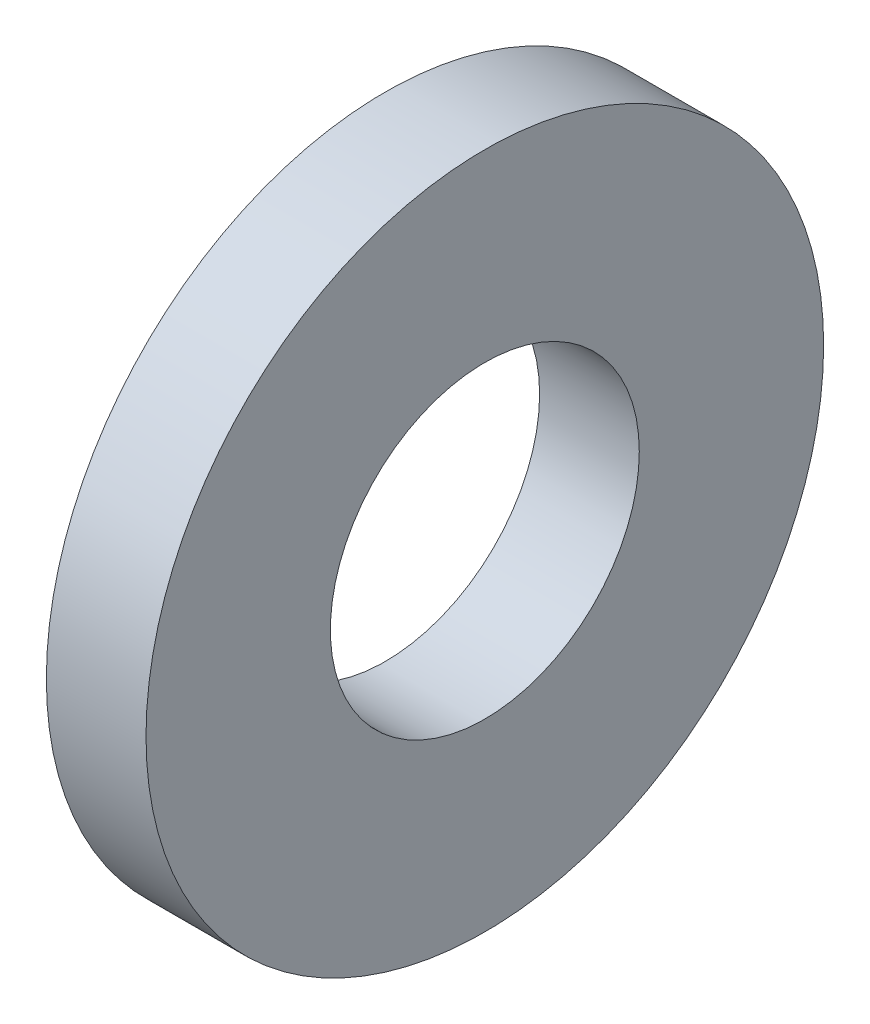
from build123d import *

# Parameters (mm, degrees)
SKETCH1_R          = 34
SKETCH1_R_2        = 15.5
BASE_EXTRUDE_DEPTH = 10


with BuildPart() as part:
    # Sketch1 → Base-Extrude (new body)
    with BuildSketch(Plane(origin=(0, 0, 0), x_dir=(0, 0, -1), z_dir=(1, 0, 0))):
        Circle(SKETCH1_R)
        Circle(SKETCH1_R_2, mode=Mode.SUBTRACT)
    extrude(amount=BASE_EXTRUDE_DEPTH)


solid = part.part
